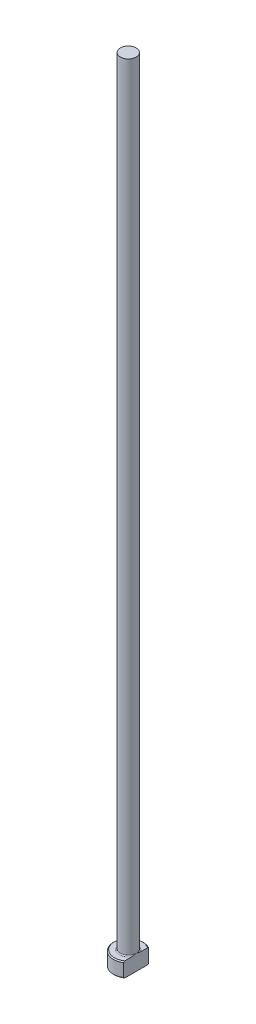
ISO-10303-21;
HEADER;
FILE_DESCRIPTION(('STEP AP214'),'2;1');
FILE_NAME('part.step','',(''),(''),'','','');
FILE_SCHEMA(('AUTOMOTIVE_DESIGN { 1 0 10303 214 1 1 1 1 }'));
ENDSEC;
DATA;
#1=APPLICATION_CONTEXT('core data for automotive mechanical design processes');
#2=APPLICATION_PROTOCOL_DEFINITION('international standard','automotive_design',2000,#1);
#3=PRODUCT_CONTEXT('',#1,'mechanical');
#4=PRODUCT('Part','Part','',(#3));
#5=PRODUCT_RELATED_PRODUCT_CATEGORY('part','',(#4));
#6=PRODUCT_DEFINITION_FORMATION('','',#4);
#7=PRODUCT_DEFINITION_CONTEXT('part definition',#1,'design');
#8=PRODUCT_DEFINITION('design','',#6,#7);
#9=PRODUCT_DEFINITION_SHAPE('','',#8);
#10=(LENGTH_UNIT() NAMED_UNIT(*) SI_UNIT(.MILLI.,.METRE.));
#11=(NAMED_UNIT(*) PLANE_ANGLE_UNIT() SI_UNIT($,.RADIAN.));
#12=(NAMED_UNIT(*) SI_UNIT($,.STERADIAN.) SOLID_ANGLE_UNIT());
#13=UNCERTAINTY_MEASURE_WITH_UNIT(LENGTH_MEASURE(1.E-05),#10,'distance_accuracy_value','');
#14=(GEOMETRIC_REPRESENTATION_CONTEXT(3) GLOBAL_UNCERTAINTY_ASSIGNED_CONTEXT((#13)) GLOBAL_UNIT_ASSIGNED_CONTEXT((#10,
#11,#12)) REPRESENTATION_CONTEXT('',''));
#15=CARTESIAN_POINT('',(0.,0.,0.));
#16=DIRECTION('',(0.,0.,1.));
#17=DIRECTION('',(1.,0.,0.));
#18=AXIS2_PLACEMENT_3D('',#15,#16,#17);
#19=CARTESIAN_POINT('',(0.,0.,0.));
#20=DIRECTION('',(0.,-1.,0.));
#21=DIRECTION('',(0.,0.,-1.));
#22=AXIS2_PLACEMENT_3D('',#19,#20,#21);
#23=PLANE('',#22);
#24=CARTESIAN_POINT('',(0.,0.,0.));
#25=DIRECTION('',(0.,-1.,0.));
#26=DIRECTION('',(0.,0.,-1.));
#27=AXIS2_PLACEMENT_3D('',#24,#25,#26);
#28=CIRCLE('',#27,2.79999999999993);
#29=CARTESIAN_POINT('',(1.59999999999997,0.,2.29782505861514));
#30=VERTEX_POINT('',#29);
#31=CARTESIAN_POINT('',(1.59999999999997,0.,-2.29782505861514));
#32=VERTEX_POINT('',#31);
#33=EDGE_CURVE('E98',#30,#32,#28,.T.);
#34=ORIENTED_EDGE('',*,*,#33,.T.);
#35=DIRECTION('',(0.,0.,1.));
#36=VECTOR('',#35,1.);
#37=CARTESIAN_POINT('',(1.59999999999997,0.,-2.53771550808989));
#38=LINE('',#37,#36);
#39=EDGE_CURVE('E83',#32,#30,#38,.T.);
#40=ORIENTED_EDGE('',*,*,#39,.T.);
#41=EDGE_LOOP('',(#34,#40));
#42=FACE_BOUND('',#41,.T.);
#43=ADVANCED_FACE('F32',(#42),#23,.T.);
#44=CARTESIAN_POINT('',(0.,259.958771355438,0.));
#45=DIRECTION('',(0.,1.,0.));
#46=DIRECTION('',(0.,0.,1.));
#47=AXIS2_PLACEMENT_3D('',#44,#45,#46);
#48=CYLINDRICAL_SURFACE('',#47,2.99999999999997);
#49=CARTESIAN_POINT('',(0.,2.80000000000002,0.));
#50=DIRECTION('',(0.,1.,0.));
#51=DIRECTION('',(0.,0.,1.));
#52=AXIS2_PLACEMENT_3D('',#49,#50,#51);
#53=CIRCLE('',#52,2.99999999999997);
#54=CARTESIAN_POINT('',(1.59999999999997,2.80000000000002,2.53771550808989));
#55=VERTEX_POINT('',#54);
#56=CARTESIAN_POINT('',(1.59999999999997,2.80000000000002,-2.53771550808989));
#57=VERTEX_POINT('',#56);
#58=EDGE_CURVE('E104',#55,#57,#53,.F.);
#59=ORIENTED_EDGE('',*,*,#58,.T.);
#60=DIRECTION('',(0.,-1.,0.));
#61=VECTOR('',#60,1.);
#62=CARTESIAN_POINT('',(1.59999999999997,160.,-2.53771550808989));
#63=LINE('',#62,#61);
#64=CARTESIAN_POINT('',(1.59999999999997,0.200000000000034,-2.53771550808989));
#65=VERTEX_POINT('',#64);
#66=EDGE_CURVE('E183',#57,#65,#63,.T.);
#67=ORIENTED_EDGE('',*,*,#66,.T.);
#68=CARTESIAN_POINT('',(0.,0.200000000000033,0.));
#69=DIRECTION('',(0.,-1.,0.));
#70=DIRECTION('',(0.,0.,-1.));
#71=AXIS2_PLACEMENT_3D('',#68,#69,#70);
#72=CIRCLE('',#71,2.99999999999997);
#73=CARTESIAN_POINT('',(1.59999999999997,0.200000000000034,2.53771550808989));
#74=VERTEX_POINT('',#73);
#75=EDGE_CURVE('E100',#65,#74,#72,.F.);
#76=ORIENTED_EDGE('',*,*,#75,.T.);
#77=DIRECTION('',(0.,-1.,0.));
#78=VECTOR('',#77,1.);
#79=CARTESIAN_POINT('',(1.59999999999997,160.,2.53771550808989));
#80=LINE('',#79,#78);
#81=EDGE_CURVE('E93',#55,#74,#80,.T.);
#82=ORIENTED_EDGE('',*,*,#81,.F.);
#83=EDGE_LOOP('',(#59,#67,#76,#82));
#84=FACE_BOUND('',#83,.T.);
#85=ADVANCED_FACE('F158',(#84),#48,.T.);
#86=CARTESIAN_POINT('',(-2.99999999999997,3.,0.));
#87=DIRECTION('',(0.,1.,0.));
#88=DIRECTION('',(0.,0.,1.));
#89=AXIS2_PLACEMENT_3D('',#86,#87,#88);
#90=PLANE('',#89);
#91=CARTESIAN_POINT('',(0.,3.,0.));
#92=DIRECTION('',(0.,1.,0.));
#93=DIRECTION('',(0.,0.,1.));
#94=AXIS2_PLACEMENT_3D('',#91,#92,#93);
#95=CIRCLE('',#94,2.79999999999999);
#96=CARTESIAN_POINT('',(1.59999999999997,3.,-2.29782505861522));
#97=VERTEX_POINT('',#96);
#98=CARTESIAN_POINT('',(1.59999999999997,3.,2.29782505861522));
#99=VERTEX_POINT('',#98);
#100=EDGE_CURVE('E178',#97,#99,#95,.T.);
#101=ORIENTED_EDGE('',*,*,#100,.T.);
#102=DIRECTION('',(0.,0.,-1.));
#103=VECTOR('',#102,1.);
#104=CARTESIAN_POINT('',(1.59999999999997,3.,0.));
#105=LINE('',#104,#103);
#106=CARTESIAN_POINT('',(1.59999999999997,2.99999999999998,0.824621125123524));
#107=VERTEX_POINT('',#106);
#108=EDGE_CURVE('E57',#99,#107,#105,.T.);
#109=ORIENTED_EDGE('',*,*,#108,.T.);
#110=CARTESIAN_POINT('',(0.,3.,0.));
#111=DIRECTION('',(0.,1.,0.));
#112=DIRECTION('',(0.,0.,1.));
#113=AXIS2_PLACEMENT_3D('',#110,#111,#112);
#114=CIRCLE('',#113,1.79999999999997);
#115=CARTESIAN_POINT('',(1.59999999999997,2.99999999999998,-0.824621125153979));
#116=VERTEX_POINT('',#115);
#117=EDGE_CURVE('E107',#107,#116,#114,.F.);
#118=ORIENTED_EDGE('',*,*,#117,.T.);
#119=EDGE_CURVE('E136',#116,#97,#105,.T.);
#120=ORIENTED_EDGE('',*,*,#119,.T.);
#121=EDGE_LOOP('',(#101,#109,#118,#120));
#122=FACE_BOUND('',#121,.T.);
#123=ADVANCED_FACE('F147',(#122),#90,.T.);
#124=CARTESIAN_POINT('',(0.,3.,0.));
#125=DIRECTION('',(0.,-1.,0.));
#126=DIRECTION('',(0.,0.,-1.));
#127=AXIS2_PLACEMENT_3D('',#124,#125,#126);
#128=CONICAL_SURFACE('',#127,2.79999999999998,0.785398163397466);
#129=ORIENTED_EDGE('',*,*,#58,.F.);
#130=CARTESIAN_POINT('',(1.59999999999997,-0.0101832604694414,5.58553753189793));
#131=CARTESIAN_POINT('',(1.59999999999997,0.0972362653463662,5.47379440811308));
#132=CARTESIAN_POINT('',(1.59999999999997,0.204532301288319,5.36193239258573));
#133=CARTESIAN_POINT('',(1.59999999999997,0.418819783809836,5.13791519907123));
#134=CARTESIAN_POINT('',(1.59999999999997,0.525811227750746,5.02576001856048));
#135=CARTESIAN_POINT('',(1.59999999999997,0.846303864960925,4.68870684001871));
#136=CARTESIAN_POINT('',(1.59999999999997,1.05925853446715,4.46328850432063));
#137=CARTESIAN_POINT('',(1.59999999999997,1.48118306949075,4.01229981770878));
#138=CARTESIAN_POINT('',(1.59999999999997,1.69017139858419,3.78674682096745));
#139=CARTESIAN_POINT('',(1.59999999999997,2.00096196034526,3.44598591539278));
#140=CARTESIAN_POINT('',(1.59999999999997,2.1041038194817,3.33200088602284));
#141=CARTESIAN_POINT('',(1.59999999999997,2.30919104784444,3.10296070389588));
#142=CARTESIAN_POINT('',(1.59999999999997,2.4111364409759,2.98790557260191));
#143=CARTESIAN_POINT('',(1.59999999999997,2.58757545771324,2.78593338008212));
#144=CARTESIAN_POINT('',(1.59999999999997,2.66243160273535,2.69933337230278));
#145=CARTESIAN_POINT('',(1.59999999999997,2.81098408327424,2.52513170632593));
#146=CARTESIAN_POINT('',(1.59999999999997,2.88468033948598,2.43752998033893));
#147=CARTESIAN_POINT('',(1.59999999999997,3.03092909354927,2.26058626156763));
#148=CARTESIAN_POINT('',(1.59999999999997,3.10347340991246,2.17123748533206));
#149=CARTESIAN_POINT('',(1.59999999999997,3.2464536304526,1.99088530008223));
#150=CARTESIAN_POINT('',(1.59999999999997,3.31688989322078,1.89988217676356));
#151=CARTESIAN_POINT('',(1.59999999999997,3.4554392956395,1.71486621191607));
#152=CARTESIAN_POINT('',(1.59999999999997,3.52352676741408,1.62083402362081));
#153=CARTESIAN_POINT('',(1.59999999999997,3.6554393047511,1.42966446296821));
#154=CARTESIAN_POINT('',(1.59999999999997,3.71926060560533,1.33252445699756));
#155=CARTESIAN_POINT('',(1.59999999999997,3.84005824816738,1.13468126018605));
#156=CARTESIAN_POINT('',(1.59999999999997,3.89706669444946,1.03399793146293));
#157=CARTESIAN_POINT('',(1.59999999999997,4.0008785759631,0.827509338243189));
#158=CARTESIAN_POINT('',(1.59999999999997,4.04770238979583,0.721714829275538));
#159=CARTESIAN_POINT('',(1.59999999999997,4.10597629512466,0.55880924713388));
#160=CARTESIAN_POINT('',(1.59999999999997,4.12339902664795,0.503846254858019));
#161=CARTESIAN_POINT('',(1.59999999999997,4.15340775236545,0.392598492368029));
#162=CARTESIAN_POINT('',(1.59999999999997,4.16599453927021,0.336313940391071));
#163=CARTESIAN_POINT('',(1.59999999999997,4.18546795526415,0.223146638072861));
#164=CARTESIAN_POINT('',(1.59999999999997,4.19239315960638,0.166270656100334));
#165=CARTESIAN_POINT('',(1.59999999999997,4.20016451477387,0.0521012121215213));
#166=CARTESIAN_POINT('',(1.59999999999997,4.2010113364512,-0.00519220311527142));
#167=CARTESIAN_POINT('',(1.59999999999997,4.19655603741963,-0.119606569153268));
#168=CARTESIAN_POINT('',(1.59999999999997,4.19124611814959,-0.176727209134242));
#169=CARTESIAN_POINT('',(1.59999999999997,4.17487728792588,-0.290132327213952));
#170=CARTESIAN_POINT('',(1.59999999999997,4.1638171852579,-0.346416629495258));
#171=CARTESIAN_POINT('',(1.59999999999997,4.13658168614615,-0.458175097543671));
#172=CARTESIAN_POINT('',(1.59999999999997,4.12036718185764,-0.513639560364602));
#173=CARTESIAN_POINT('',(1.59999999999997,4.08371568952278,-0.623133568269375));
#174=CARTESIAN_POINT('',(1.59999999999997,4.06327861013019,-0.677163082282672));
#175=CARTESIAN_POINT('',(1.59999999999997,4.01384079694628,-0.796206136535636));
#176=CARTESIAN_POINT('',(1.59999999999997,3.98395404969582,-0.860848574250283));
#177=CARTESIAN_POINT('',(1.59999999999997,3.92024875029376,-0.988182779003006));
#178=CARTESIAN_POINT('',(1.59999999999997,3.88642788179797,-1.05087336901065));
#179=CARTESIAN_POINT('',(1.59999999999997,3.81575061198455,-1.17466308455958));
#180=CARTESIAN_POINT('',(1.59999999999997,3.77888858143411,-1.23575897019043));
#181=CARTESIAN_POINT('',(1.59999999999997,3.70287361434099,-1.35651466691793));
#182=CARTESIAN_POINT('',(1.59999999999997,3.66372022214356,-1.41617418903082));
#183=CARTESIAN_POINT('',(1.59999999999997,3.54280392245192,-1.59458184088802));
#184=CARTESIAN_POINT('',(1.59999999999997,3.45833719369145,-1.7114924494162));
#185=CARTESIAN_POINT('',(1.59999999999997,3.28508486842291,-1.94177313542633));
#186=CARTESIAN_POINT('',(1.59999999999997,3.19630496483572,-2.05514757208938));
#187=CARTESIAN_POINT('',(1.59999999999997,2.98139222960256,-2.32229937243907));
#188=CARTESIAN_POINT('',(1.59999999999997,2.85392433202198,-2.47499901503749));
#189=CARTESIAN_POINT('',(1.59999999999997,2.59557502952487,-2.7774916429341));
#190=CARTESIAN_POINT('',(1.59999999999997,2.46469312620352,-2.92728419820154));
#191=CARTESIAN_POINT('',(1.59999999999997,2.20054459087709,-3.22502658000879));
#192=CARTESIAN_POINT('',(1.59999999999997,2.06727561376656,-3.37297432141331));
#193=CARTESIAN_POINT('',(1.59999999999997,1.79919464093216,-3.66744344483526));
#194=CARTESIAN_POINT('',(1.59999999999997,1.66438274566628,-3.81396491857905));
#195=CARTESIAN_POINT('',(1.59999999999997,1.40205824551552,-4.09689102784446));
#196=CARTESIAN_POINT('',(1.59999999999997,1.27461301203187,-4.23335821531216));
#197=CARTESIAN_POINT('',(1.59999999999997,1.01897493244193,-4.50559511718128));
#198=CARTESIAN_POINT('',(1.59999999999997,0.890782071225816,-4.64136481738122));
#199=CARTESIAN_POINT('',(1.59999999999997,0.634049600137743,-4.91211710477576));
#200=CARTESIAN_POINT('',(1.59999999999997,0.50551101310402,-5.04710066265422));
#201=CARTESIAN_POINT('',(1.59999999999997,0.247978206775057,-5.31662434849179));
#202=CARTESIAN_POINT('',(1.59999999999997,0.118984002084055,-5.45116449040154));
#203=CARTESIAN_POINT('',(1.59999999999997,-0.0101832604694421,-5.58553753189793));
#204=B_SPLINE_CURVE_WITH_KNOTS('',3,(#130,#131,#132,#133,#134,#135,#136,#137,#138,#139,#140,
#141,#142,#143,#144,#145,#146,#147,#148,#149,#150,#151,#152,#153,#154,#155,#156,#157,#158,#159,
#160,#161,#162,#163,#164,#165,#166,#167,#168,#169,#170,#171,#172,#173,#174,#175,#176,#177,#178,
#179,#180,#181,#182,#183,#184,#185,#186,#187,#188,#189,#190,#191,#192,#193,#194,#195,#196,#197,
#198,#199,#200,#201,#202,#203),.UNSPECIFIED.,.F.,.F.,(4,2,2,2,2,2,2,2,2,2,2,2,2,2,2,2,2,2,2,2,2,
2,2,2,2,2,2,2,2,2,2,2,2,2,2,2,4),(0.,0.465004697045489,0.930013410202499,1.86031116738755,
2.7827539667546,3.24391793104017,3.70507266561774,4.04847005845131,4.39189082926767,
4.73714054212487,5.08233118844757,5.43053718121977,5.77904650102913,6.12584271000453,
6.47193849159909,6.644737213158,6.81750759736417,6.98909076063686,7.16065498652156,
7.33243676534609,7.50425415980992,7.67740760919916,7.85056480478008,8.06403310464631,
8.27762773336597,8.49162700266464,8.70566897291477,9.1381640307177,9.57010297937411,
10.166739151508,10.763462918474,11.3608091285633,11.9581166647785,12.5182829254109,
13.0784605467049,13.6376414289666,14.1968045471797),.UNSPECIFIED.);
#205=EDGE_CURVE('E135',#55,#99,#204,.T.);
#206=ORIENTED_EDGE('',*,*,#205,.T.);
#207=ORIENTED_EDGE('',*,*,#100,.F.);
#208=EDGE_CURVE('E127',#97,#57,#204,.T.);
#209=ORIENTED_EDGE('',*,*,#208,.T.);
#210=EDGE_LOOP('',(#129,#206,#207,#209));
#211=FACE_BOUND('',#210,.T.);
#212=ADVANCED_FACE('F143',(#211),#128,.T.);
#213=CARTESIAN_POINT('',(0.,0.200000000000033,0.));
#214=DIRECTION('',(0.,1.,0.));
#215=DIRECTION('',(0.,0.,1.));
#216=AXIS2_PLACEMENT_3D('',#213,#214,#215);
#217=CONICAL_SURFACE('',#216,2.99999999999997,0.785398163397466);
#218=ORIENTED_EDGE('',*,*,#75,.F.);
#219=CARTESIAN_POINT('',(1.59999999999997,3.0101832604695,-5.58553753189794));
#220=CARTESIAN_POINT('',(1.59999999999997,2.90276373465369,-5.47379440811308));
#221=CARTESIAN_POINT('',(1.59999999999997,2.79546769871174,-5.36193239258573));
#222=CARTESIAN_POINT('',(1.59999999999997,2.58118021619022,-5.13791519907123));
#223=CARTESIAN_POINT('',(1.59999999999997,2.47418877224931,-5.02576001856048));
#224=CARTESIAN_POINT('',(1.59999999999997,2.15369613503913,-4.68870684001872));
#225=CARTESIAN_POINT('',(1.59999999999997,1.94074146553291,-4.46328850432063));
#226=CARTESIAN_POINT('',(1.59999999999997,1.5188169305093,-4.01229981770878));
#227=CARTESIAN_POINT('',(1.59999999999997,1.30982860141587,-3.78674682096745));
#228=CARTESIAN_POINT('',(1.59999999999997,0.9990380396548,-3.44598591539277));
#229=CARTESIAN_POINT('',(1.59999999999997,0.895896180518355,-3.33200088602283));
#230=CARTESIAN_POINT('',(1.59999999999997,0.690808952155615,-3.10296070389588));
#231=CARTESIAN_POINT('',(1.59999999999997,0.588863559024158,-2.98790557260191));
#232=CARTESIAN_POINT('',(1.59999999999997,0.412424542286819,-2.78593338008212));
#233=CARTESIAN_POINT('',(1.59999999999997,0.337568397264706,-2.69933337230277));
#234=CARTESIAN_POINT('',(1.59999999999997,0.189015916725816,-2.52513170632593));
#235=CARTESIAN_POINT('',(1.59999999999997,0.115319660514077,-2.43752998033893));
#236=CARTESIAN_POINT('',(1.59999999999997,-0.0309290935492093,-2.26058626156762));
#237=CARTESIAN_POINT('',(1.59999999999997,-0.103473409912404,-2.17123748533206));
#238=CARTESIAN_POINT('',(1.59999999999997,-0.246453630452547,-1.99088530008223));
#239=CARTESIAN_POINT('',(1.59999999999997,-0.316889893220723,-1.89988217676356));
#240=CARTESIAN_POINT('',(1.59999999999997,-0.455439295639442,-1.71486621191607));
#241=CARTESIAN_POINT('',(1.59999999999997,-0.523526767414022,-1.62083402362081));
#242=CARTESIAN_POINT('',(1.59999999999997,-0.655439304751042,-1.42966446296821));
#243=CARTESIAN_POINT('',(1.59999999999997,-0.719260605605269,-1.33252445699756));
#244=CARTESIAN_POINT('',(1.59999999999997,-0.840058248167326,-1.13468126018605));
#245=CARTESIAN_POINT('',(1.59999999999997,-0.897066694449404,-1.03399793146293));
#246=CARTESIAN_POINT('',(1.59999999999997,-1.00087857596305,-0.82750933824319));
#247=CARTESIAN_POINT('',(1.59999999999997,-1.04770238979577,-0.72171482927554));
#248=CARTESIAN_POINT('',(1.59999999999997,-1.1059762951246,-0.558809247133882));
#249=CARTESIAN_POINT('',(1.59999999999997,-1.12339902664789,-0.50384625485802));
#250=CARTESIAN_POINT('',(1.59999999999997,-1.15340775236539,-0.39259849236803));
#251=CARTESIAN_POINT('',(1.59999999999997,-1.16599453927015,-0.336313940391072));
#252=CARTESIAN_POINT('',(1.59999999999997,-1.18546795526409,-0.223146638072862));
#253=CARTESIAN_POINT('',(1.59999999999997,-1.19239315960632,-0.166270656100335));
#254=CARTESIAN_POINT('',(1.59999999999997,-1.20016451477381,-0.0521012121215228));
#255=CARTESIAN_POINT('',(1.59999999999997,-1.20101133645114,0.00519220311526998));
#256=CARTESIAN_POINT('',(1.59999999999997,-1.19655603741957,0.119606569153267));
#257=CARTESIAN_POINT('',(1.59999999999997,-1.19124611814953,0.176727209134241));
#258=CARTESIAN_POINT('',(1.59999999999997,-1.17487728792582,0.290132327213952));
#259=CARTESIAN_POINT('',(1.59999999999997,-1.16381718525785,0.346416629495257));
#260=CARTESIAN_POINT('',(1.59999999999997,-1.1365816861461,0.45817509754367));
#261=CARTESIAN_POINT('',(1.59999999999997,-1.12036718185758,0.5136395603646));
#262=CARTESIAN_POINT('',(1.59999999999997,-1.08371568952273,0.623133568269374));
#263=CARTESIAN_POINT('',(1.59999999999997,-1.06327861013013,0.677163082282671));
#264=CARTESIAN_POINT('',(1.59999999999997,-1.01384079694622,0.796206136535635));
#265=CARTESIAN_POINT('',(1.59999999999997,-0.983954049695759,0.860848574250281));
#266=CARTESIAN_POINT('',(1.59999999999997,-0.920248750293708,0.988182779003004));
#267=CARTESIAN_POINT('',(1.59999999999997,-0.886427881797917,1.05087336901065));
#268=CARTESIAN_POINT('',(1.59999999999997,-0.815750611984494,1.17466308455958));
#269=CARTESIAN_POINT('',(1.59999999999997,-0.778888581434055,1.23575897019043));
#270=CARTESIAN_POINT('',(1.59999999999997,-0.702873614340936,1.35651466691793));
#271=CARTESIAN_POINT('',(1.59999999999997,-0.663720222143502,1.41617418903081));
#272=CARTESIAN_POINT('',(1.59999999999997,-0.542803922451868,1.59458184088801));
#273=CARTESIAN_POINT('',(1.59999999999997,-0.458337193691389,1.7114924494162));
#274=CARTESIAN_POINT('',(1.59999999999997,-0.28508486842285,1.94177313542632));
#275=CARTESIAN_POINT('',(1.59999999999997,-0.196304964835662,2.05514757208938));
#276=CARTESIAN_POINT('',(1.59999999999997,0.0186077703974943,2.32229937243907));
#277=CARTESIAN_POINT('',(1.59999999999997,0.146075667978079,2.47499901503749));
#278=CARTESIAN_POINT('',(1.59999999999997,0.404424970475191,2.7774916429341));
#279=CARTESIAN_POINT('',(1.59999999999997,0.535306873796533,2.92728419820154));
#280=CARTESIAN_POINT('',(1.59999999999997,0.799455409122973,3.22502658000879));
#281=CARTESIAN_POINT('',(1.59999999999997,0.932724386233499,3.37297432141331));
#282=CARTESIAN_POINT('',(1.59999999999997,1.20080535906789,3.66744344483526));
#283=CARTESIAN_POINT('',(1.59999999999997,1.33561725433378,3.81396491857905));
#284=CARTESIAN_POINT('',(1.59999999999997,1.59794175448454,4.09689102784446));
#285=CARTESIAN_POINT('',(1.59999999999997,1.72538698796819,4.23335821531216));
#286=CARTESIAN_POINT('',(1.59999999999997,1.98102506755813,4.50559511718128));
#287=CARTESIAN_POINT('',(1.59999999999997,2.10921792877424,4.64136481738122));
#288=CARTESIAN_POINT('',(1.59999999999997,2.36595039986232,4.91211710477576));
#289=CARTESIAN_POINT('',(1.59999999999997,2.49448898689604,5.04710066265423));
#290=CARTESIAN_POINT('',(1.59999999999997,2.752021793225,5.31662434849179));
#291=CARTESIAN_POINT('',(1.59999999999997,2.881015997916,5.45116449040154));
#292=CARTESIAN_POINT('',(1.59999999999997,3.0101832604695,5.58553753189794));
#293=B_SPLINE_CURVE_WITH_KNOTS('',3,(#219,#220,#221,#222,#223,#224,#225,#226,#227,#228,#229,
#230,#231,#232,#233,#234,#235,#236,#237,#238,#239,#240,#241,#242,#243,#244,#245,#246,#247,#248,
#249,#250,#251,#252,#253,#254,#255,#256,#257,#258,#259,#260,#261,#262,#263,#264,#265,#266,#267,
#268,#269,#270,#271,#272,#273,#274,#275,#276,#277,#278,#279,#280,#281,#282,#283,#284,#285,#286,
#287,#288,#289,#290,#291,#292),.UNSPECIFIED.,.F.,.F.,(4,2,2,2,2,2,2,2,2,2,2,2,2,2,2,2,2,2,2,2,2,
2,2,2,2,2,2,2,2,2,2,2,2,2,2,2,4),(0.,0.46500469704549,0.9300134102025,1.86031116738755,
2.7827539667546,3.24391793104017,3.70507266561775,4.04847005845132,4.39189082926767,
4.73714054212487,5.08233118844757,5.43053718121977,5.77904650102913,6.12584271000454,
6.47193849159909,6.644737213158,6.81750759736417,6.98909076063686,7.16065498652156,
7.3324367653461,7.50425415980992,7.67740760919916,7.85056480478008,8.06403310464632,
8.27762773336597,8.49162700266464,8.70566897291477,9.1381640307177,9.57010297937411,
10.166739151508,10.763462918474,11.3608091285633,11.9581166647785,12.5182829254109,
13.0784605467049,13.6376414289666,14.1968045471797),.UNSPECIFIED.);
#294=EDGE_CURVE('E86',#65,#32,#293,.T.);
#295=ORIENTED_EDGE('',*,*,#294,.T.);
#296=ORIENTED_EDGE('',*,*,#33,.F.);
#297=EDGE_CURVE('E89',#30,#74,#293,.T.);
#298=ORIENTED_EDGE('',*,*,#297,.T.);
#299=EDGE_LOOP('',(#218,#295,#296,#298));
#300=FACE_BOUND('',#299,.T.);
#301=ADVANCED_FACE('F97',(#300),#217,.T.);
#302=CARTESIAN_POINT('',(0.,3.19999999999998,0.));
#303=DIRECTION('',(0.,1.,0.));
#304=DIRECTION('',(0.,0.,1.));
#305=AXIS2_PLACEMENT_3D('',#302,#303,#304);
#306=TOROIDAL_SURFACE('',#305,1.79999999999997,0.2);
#307=CARTESIAN_POINT('',(1.59999999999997,3.19999999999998,0.));
#308=CARTESIAN_POINT('',(1.59999999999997,3.20000050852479,4.54943754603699E-11));
#309=CARTESIAN_POINT('',(1.59999999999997,3.20000101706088,-1.26961255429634E-07));
#310=CARTESIAN_POINT('',(1.59999999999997,3.20000198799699,-5.15663776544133E-07));
#311=CARTESIAN_POINT('',(1.59999999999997,3.20000244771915,-7.82570768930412E-07));
#312=CARTESIAN_POINT('',(1.59999999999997,3.20000337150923,-1.42107859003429E-06));
#313=CARTESIAN_POINT('',(1.59999999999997,3.2000038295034,-1.8013897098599E-06));
#314=CARTESIAN_POINT('',(1.59999999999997,3.20000468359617,-2.61302269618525E-06));
#315=CARTESIAN_POINT('',(1.59999999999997,3.20000508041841,-3.04362154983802E-06));
#316=CARTESIAN_POINT('',(1.59999999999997,3.20000644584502,-4.61783099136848E-06));
#317=CARTESIAN_POINT('',(1.59999999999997,3.2000073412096,-5.82629496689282E-06));
#318=CARTESIAN_POINT('',(1.59999999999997,3.20000890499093,-8.29532278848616E-06));
#319=CARTESIAN_POINT('',(1.59999999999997,3.2000095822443,-9.55059430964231E-06));
#320=CARTESIAN_POINT('',(1.59999999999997,3.2000122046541,-1.4561779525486E-05));
#321=CARTESIAN_POINT('',(1.59999999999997,3.20001402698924,-1.8385925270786E-05));
#322=CARTESIAN_POINT('',(1.59999999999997,3.20001693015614,-2.58398167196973E-05));
#323=CARTESIAN_POINT('',(1.59999999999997,3.20001806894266,-2.9447492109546E-05));
#324=CARTESIAN_POINT('',(1.59999999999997,3.20002303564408,-4.5117550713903E-05));
#325=CARTESIAN_POINT('',(1.59999999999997,3.20002690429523,-5.71577768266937E-05));
#326=CARTESIAN_POINT('',(1.59999999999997,3.20003298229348,-7.95113108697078E-05));
#327=CARTESIAN_POINT('',(1.59999999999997,3.20003536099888,-8.97762976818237E-05));
#328=CARTESIAN_POINT('',(1.59999999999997,3.20005453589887,-0.000165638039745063));
#329=CARTESIAN_POINT('',(1.59999999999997,3.20007944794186,-0.000228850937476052));
#330=CARTESIAN_POINT('',(1.59999999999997,3.20017354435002,-0.000476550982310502));
#331=CARTESIAN_POINT('',(1.59999999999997,3.20023667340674,-0.000662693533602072));
#332=CARTESIAN_POINT('',(1.59999999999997,3.2004875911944,-0.00139193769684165));
#333=CARTESIAN_POINT('',(1.59999999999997,3.20068172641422,-0.00193335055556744));
#334=CARTESIAN_POINT('',(1.59999999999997,3.20147743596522,-0.00416279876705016));
#335=CARTESIAN_POINT('',(1.59999999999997,3.20207183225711,-0.00585269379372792));
#336=CARTESIAN_POINT('',(1.59999999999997,3.2087643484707,-0.0248666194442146));
#337=CARTESIAN_POINT('',(1.59999999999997,3.21490191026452,-0.0421807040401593));
#338=CARTESIAN_POINT('',(1.59999999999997,3.22687857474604,-0.0761752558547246));
#339=CARTESIAN_POINT('',(1.59999999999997,3.23272018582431,-0.092854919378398));
#340=CARTESIAN_POINT('',(1.59999999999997,3.2450295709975,-0.128242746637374));
#341=CARTESIAN_POINT('',(1.59999999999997,3.25148835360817,-0.146954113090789));
#342=CARTESIAN_POINT('',(1.59999999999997,3.26432449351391,-0.18462192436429));
#343=CARTESIAN_POINT('',(1.59999999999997,3.27070030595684,-0.203578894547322));
#344=CARTESIAN_POINT('',(1.59999999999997,3.2861130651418,-0.250227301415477));
#345=CARTESIAN_POINT('',(1.59999999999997,3.29503653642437,-0.277956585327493));
#346=CARTESIAN_POINT('',(1.59999999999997,3.31206503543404,-0.332930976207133));
#347=CARTESIAN_POINT('',(1.59999999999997,3.32018465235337,-0.360171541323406));
#348=CARTESIAN_POINT('',(1.59999999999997,3.33730366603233,-0.420681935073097));
#349=CARTESIAN_POINT('',(1.59999999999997,3.34612355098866,-0.454003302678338));
#350=CARTESIAN_POINT('',(1.59999999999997,3.36232017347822,-0.521270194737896));
#351=CARTESIAN_POINT('',(1.59999999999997,3.36968538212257,-0.555218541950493));
#352=CARTESIAN_POINT('',(1.59999999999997,3.38286655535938,-0.625950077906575));
#353=CARTESIAN_POINT('',(1.59999999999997,3.3885334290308,-0.6627618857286));
#354=CARTESIAN_POINT('',(1.59999999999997,3.3967820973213,-0.736647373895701));
#355=CARTESIAN_POINT('',(1.59999999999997,3.39937308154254,-0.773719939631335));
#356=CARTESIAN_POINT('',(1.59999999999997,3.40041949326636,-0.847207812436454));
#357=CARTESIAN_POINT('',(1.59999999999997,3.39895641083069,-0.88362147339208));
#358=CARTESIAN_POINT('',(1.59999999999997,3.39061157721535,-0.955314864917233));
#359=CARTESIAN_POINT('',(1.59999999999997,3.3838299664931,-0.990603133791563));
#360=CARTESIAN_POINT('',(1.59999999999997,3.36933665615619,-1.03710764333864));
#361=CARTESIAN_POINT('',(1.59999999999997,3.36495855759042,-1.04936206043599));
#362=CARTESIAN_POINT('',(1.59999999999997,3.35498242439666,-1.07342013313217));
#363=CARTESIAN_POINT('',(1.59999999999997,3.34938064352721,-1.08522227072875));
#364=CARTESIAN_POINT('',(1.59999999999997,3.33671785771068,-1.10815425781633));
#365=CARTESIAN_POINT('',(1.59999999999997,3.32964542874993,-1.11927790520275));
#366=CARTESIAN_POINT('',(1.59999999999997,3.31385032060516,-1.14028316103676));
#367=CARTESIAN_POINT('',(1.59999999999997,3.30513251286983,-1.15016829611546));
#368=CARTESIAN_POINT('',(1.59999999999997,3.2893714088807,-1.16476986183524));
#369=CARTESIAN_POINT('',(1.59999999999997,3.28286385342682,-1.17006219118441));
#370=CARTESIAN_POINT('',(1.59999999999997,3.26911414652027,-1.179603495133));
#371=CARTESIAN_POINT('',(1.59999999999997,3.2618722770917,-1.18385286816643));
#372=CARTESIAN_POINT('',(1.59999999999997,3.24665711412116,-1.19105502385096));
#373=CARTESIAN_POINT('',(1.59999999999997,3.23867649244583,-1.19399264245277));
#374=CARTESIAN_POINT('',(1.59999999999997,3.22228884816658,-1.19821047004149));
#375=CARTESIAN_POINT('',(1.59999999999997,3.21388246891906,-1.19949310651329));
#376=CARTESIAN_POINT('',(1.59999999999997,3.19822871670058,-1.20020429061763));
#377=CARTESIAN_POINT('',(1.59999999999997,3.19099166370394,-1.19987658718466));
#378=CARTESIAN_POINT('',(1.59999999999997,3.1766911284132,-1.19794337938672));
#379=CARTESIAN_POINT('',(1.59999999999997,3.16962767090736,-1.19633769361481));
#380=CARTESIAN_POINT('',(1.59999999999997,3.15619326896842,-1.19208069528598));
#381=CARTESIAN_POINT('',(1.59999999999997,3.14980538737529,-1.18948176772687));
#382=CARTESIAN_POINT('',(1.59999999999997,3.13747056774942,-1.18339991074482));
#383=CARTESIAN_POINT('',(1.59999999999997,3.13152374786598,-1.17991674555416));
#384=CARTESIAN_POINT('',(1.59999999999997,3.11701630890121,-1.17013377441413));
#385=CARTESIAN_POINT('',(1.59999999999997,3.10879365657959,-1.16333250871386));
#386=CARTESIAN_POINT('',(1.59999999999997,3.09352344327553,-1.14851362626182));
#387=CARTESIAN_POINT('',(1.59999999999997,3.08647946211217,-1.14049244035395));
#388=CARTESIAN_POINT('',(1.59999999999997,3.06978612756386,-1.11881325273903));
#389=CARTESIAN_POINT('',(1.59999999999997,3.06093454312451,-1.10454463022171));
#390=CARTESIAN_POINT('',(1.59999999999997,3.045486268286,-1.07488732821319));
#391=CARTESIAN_POINT('',(1.59999999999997,3.03889016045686,-1.05949836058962));
#392=CARTESIAN_POINT('',(1.59999999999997,3.02310414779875,-1.01585357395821));
#393=CARTESIAN_POINT('',(1.59999999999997,3.01588276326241,-0.98689334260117));
#394=CARTESIAN_POINT('',(1.59999999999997,3.00554634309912,-0.927965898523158));
#395=CARTESIAN_POINT('',(1.59999999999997,3.00248580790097,-0.89799049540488));
#396=CARTESIAN_POINT('',(1.59999999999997,2.99950013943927,-0.836442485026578));
#397=CARTESIAN_POINT('',(1.59999999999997,2.99973474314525,-0.804863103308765));
#398=CARTESIAN_POINT('',(1.59999999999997,3.00289974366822,-0.74177978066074));
#399=CARTESIAN_POINT('',(1.59999999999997,3.00583724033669,-0.710276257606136));
#400=CARTESIAN_POINT('',(1.59999999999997,3.01360294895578,-0.649223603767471));
#401=CARTESIAN_POINT('',(1.59999999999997,3.01832173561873,-0.61965999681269));
#402=CARTESIAN_POINT('',(1.59999999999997,3.02922114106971,-0.561003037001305));
#403=CARTESIAN_POINT('',(1.59999999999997,3.03539231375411,-0.531907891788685));
#404=CARTESIAN_POINT('',(1.59999999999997,3.05057454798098,-0.466833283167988));
#405=CARTESIAN_POINT('',(1.59999999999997,3.05991050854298,-0.430930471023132));
#406=CARTESIAN_POINT('',(1.59999999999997,3.08015300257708,-0.358646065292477));
#407=CARTESIAN_POINT('',(1.59999999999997,3.09109187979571,-0.322273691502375));
#408=CARTESIAN_POINT('',(1.59999999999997,3.11028869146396,-0.261379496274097));
#409=CARTESIAN_POINT('',(1.59999999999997,3.1182898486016,-0.236775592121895));
#410=CARTESIAN_POINT('',(1.59999999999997,3.13453271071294,-0.18793162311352));
#411=CARTESIAN_POINT('',(1.59999999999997,3.14277104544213,-0.163690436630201));
#412=CARTESIAN_POINT('',(1.59999999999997,3.158545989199,-0.117881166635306));
#413=CARTESIAN_POINT('',(1.59999999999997,3.16606272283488,-0.0963061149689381));
#414=CARTESIAN_POINT('',(1.59999999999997,3.18151152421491,-0.0523381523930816));
#415=CARTESIAN_POINT('',(1.59999999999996,3.18944823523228,-0.0299467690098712));
#416=CARTESIAN_POINT('',(1.59999999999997,3.19792848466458,-0.0058516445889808));
#417=CARTESIAN_POINT('',(1.59999999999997,3.19852328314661,-0.00416072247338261));
#418=CARTESIAN_POINT('',(1.59999999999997,3.19931909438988,-0.00193103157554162));
#419=CARTESIAN_POINT('',(1.59999999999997,3.19951294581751,-0.00139040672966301));
#420=CARTESIAN_POINT('',(1.59999999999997,3.19976352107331,-0.000662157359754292));
#421=CARTESIAN_POINT('',(1.59999999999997,3.19982658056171,-0.000476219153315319));
#422=CARTESIAN_POINT('',(1.59999999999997,3.19992058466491,-0.000228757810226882));
#423=CARTESIAN_POINT('',(1.59999999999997,3.19994548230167,-0.000165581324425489));
#424=CARTESIAN_POINT('',(1.59999999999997,3.19996464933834,-8.97604211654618E-05));
#425=CARTESIAN_POINT('',(1.59999999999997,3.19996702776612,-7.94979693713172E-05));
#426=CARTESIAN_POINT('',(1.59999999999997,3.19997310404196,-5.71501112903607E-05));
#427=CARTESIAN_POINT('',(1.59999999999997,3.19997697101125,-4.51129589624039E-05));
#428=CARTESIAN_POINT('',(1.59999999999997,3.19998193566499,-2.94463390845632E-05));
#429=CARTESIAN_POINT('',(1.59999999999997,3.19998307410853,-2.58390376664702E-05));
#430=CARTESIAN_POINT('',(1.59999999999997,3.1999859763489,-1.83858674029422E-05));
#431=CARTESIAN_POINT('',(1.59999999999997,3.19998779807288,-1.45620535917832E-05));
#432=CARTESIAN_POINT('',(1.59999999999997,3.19999041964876,-9.55118975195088E-06));
#433=CARTESIAN_POINT('',(1.59999999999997,3.19999109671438,-8.29594696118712E-06));
#434=CARTESIAN_POINT('',(1.59999999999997,3.19999266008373,-5.82694057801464E-06));
#435=CARTESIAN_POINT('',(1.59999999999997,3.19999355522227,-4.61846686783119E-06));
#436=CARTESIAN_POINT('',(1.59999999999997,3.19999492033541,-3.04420143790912E-06));
#437=CARTESIAN_POINT('',(1.59999999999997,3.19999531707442,-2.61357770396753E-06));
#438=CARTESIAN_POINT('',(1.59999999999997,3.19999617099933,-1.80187998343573E-06));
#439=CARTESIAN_POINT('',(1.59999999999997,3.19999662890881,-1.4215287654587E-06));
#440=CARTESIAN_POINT('',(1.59999999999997,3.19999755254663,-7.8292447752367E-07));
#441=CARTESIAN_POINT('',(1.59999999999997,3.199998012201,-5.1596356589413E-07));
#442=CARTESIAN_POINT('',(1.59999999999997,3.19999898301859,-1.27129000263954E-07));
#443=CARTESIAN_POINT('',(1.59999999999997,3.19999949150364,-4.54918281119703E-11));
#444=CARTESIAN_POINT('',(1.59999999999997,3.19999999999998,0.));
#445=B_SPLINE_CURVE_WITH_KNOTS('',3,(#307,#308,#309,#310,#311,#312,#313,#314,#315,#316,#317,
#318,#319,#320,#321,#322,#323,#324,#325,#326,#327,#328,#329,#330,#331,#332,#333,#334,#335,#336,
#337,#338,#339,#340,#341,#342,#343,#344,#345,#346,#347,#348,#349,#350,#351,#352,#353,#354,#355,
#356,#357,#358,#359,#360,#361,#362,#363,#364,#365,#366,#367,#368,#369,#370,#371,#372,#373,#374,
#375,#376,#377,#378,#379,#380,#381,#382,#383,#384,#385,#386,#387,#388,#389,#390,#391,#392,#393,
#394,#395,#396,#397,#398,#399,#400,#401,#402,#403,#404,#405,#406,#407,#408,#409,#410,#411,#412,
#413,#414,#415,#416,#417,#418,#419,#420,#421,#422,#423,#424,#425,#426,#427,#428,#429,#430,#431,
#432,#433,#434,#435,#436,#437,#438,#439,#440,#441,#442,#443,#444),.UNSPECIFIED.,.T.,.F.,(4,2,2,
2,2,2,2,2,2,2,2,2,2,2,2,2,2,2,2,2,2,2,2,2,2,2,2,2,2,2,2,2,2,2,2,2,2,2,2,2,2,2,2,2,2,2,2,2,2,2,2,
2,2,2,2,2,2,2,2,2,2,2,2,2,2,2,2,2,4),(0.,1.52634300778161E-06,3.11406916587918E-06,
4.89195151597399E-06,6.64684989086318E-06,1.11381074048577E-05,1.54135914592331E-05,
2.80880177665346E-05,3.94249647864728E-05,7.7360103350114E-05,0.000108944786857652,
0.000312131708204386,0.00090234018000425,0.00262715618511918,0.00800204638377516,
0.0631063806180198,0.116126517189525,0.175509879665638,0.235510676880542,0.322894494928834,
0.408161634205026,0.511541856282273,0.615711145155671,0.727355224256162,0.838664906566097,
0.947753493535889,1.05483601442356,1.09382604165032,1.13293715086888,1.17236425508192,
1.21167640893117,1.23676182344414,1.26183763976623,1.28719627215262,1.31251766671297,
1.33413541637,1.35575623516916,1.37636641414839,1.39698209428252,1.42881268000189,
1.46073825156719,1.51082746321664,1.56092960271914,1.64997182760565,1.74016947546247,
1.83475408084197,1.92958784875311,2.01935385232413,2.10855142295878,2.21980473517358,
2.33373085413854,2.4113451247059,2.48815160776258,2.55669374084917,2.62795640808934,
2.63333459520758,2.63505690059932,2.63564646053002,2.63584953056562,2.63588110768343,
2.6359190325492,2.63593036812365,2.63594304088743,2.63594731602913,2.63595180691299,
2.63595356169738,2.63595533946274,2.63595692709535,2.63595845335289),.UNSPECIFIED.);
#446=CARTESIAN_POINT('',(1.59999999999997,3.19999999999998,0.));
#447=VERTEX_POINT('',#446);
#448=EDGE_CURVE('E11',#116,#447,#445,.T.);
#449=ORIENTED_EDGE('',*,*,#448,.F.);
#450=ORIENTED_EDGE('',*,*,#117,.F.);
#451=CARTESIAN_POINT('',(1.59999999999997,3.19999999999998,0.));
#452=CARTESIAN_POINT('',(1.59999999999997,3.19999949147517,-4.54943940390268E-11));
#453=CARTESIAN_POINT('',(1.59999999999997,3.19999898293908,1.26961255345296E-07));
#454=CARTESIAN_POINT('',(1.59999999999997,3.19999801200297,5.1566377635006E-07));
#455=CARTESIAN_POINT('',(1.59999999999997,3.19999755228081,7.82570768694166E-07));
#456=CARTESIAN_POINT('',(1.59999999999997,3.19999662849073,1.4210785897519E-06));
#457=CARTESIAN_POINT('',(1.59999999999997,3.19999617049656,1.80138970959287E-06));
#458=CARTESIAN_POINT('',(1.59999999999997,3.19999531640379,2.61302269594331E-06));
#459=CARTESIAN_POINT('',(1.59999999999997,3.19999491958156,3.04362154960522E-06));
#460=CARTESIAN_POINT('',(1.59999999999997,3.19999355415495,4.61783099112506E-06));
#461=CARTESIAN_POINT('',(1.59999999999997,3.19999265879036,5.82629496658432E-06));
#462=CARTESIAN_POINT('',(1.59999999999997,3.19999109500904,8.29532278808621E-06));
#463=CARTESIAN_POINT('',(1.59999999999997,3.19999041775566,9.55059430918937E-06));
#464=CARTESIAN_POINT('',(1.59999999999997,3.19998779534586,1.45617795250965E-05));
#465=CARTESIAN_POINT('',(1.59999999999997,3.19998597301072,1.83859252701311E-05));
#466=CARTESIAN_POINT('',(1.59999999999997,3.19998306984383,2.58398167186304E-05));
#467=CARTESIAN_POINT('',(1.59999999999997,3.1999819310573,2.94474921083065E-05));
#468=CARTESIAN_POINT('',(1.59999999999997,3.19997696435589,4.51175507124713E-05));
#469=CARTESIAN_POINT('',(1.59999999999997,3.19997309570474,5.7157776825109E-05));
#470=CARTESIAN_POINT('',(1.59999999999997,3.19996701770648,7.95113108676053E-05));
#471=CARTESIAN_POINT('',(1.59999999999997,3.19996463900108,8.9776297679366E-05));
#472=CARTESIAN_POINT('',(1.59999999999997,3.19994546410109,0.000165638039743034));
#473=CARTESIAN_POINT('',(1.59999999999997,3.1999205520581,0.000228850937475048));
#474=CARTESIAN_POINT('',(1.59999999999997,3.19982645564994,0.000476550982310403));
#475=CARTESIAN_POINT('',(1.59999999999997,3.19976332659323,0.000662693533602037));
#476=CARTESIAN_POINT('',(1.59999999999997,3.19951240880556,0.0013919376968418));
#477=CARTESIAN_POINT('',(1.59999999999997,3.19931827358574,0.0019333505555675));
#478=CARTESIAN_POINT('',(1.59999999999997,3.19852256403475,0.00416279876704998));
#479=CARTESIAN_POINT('',(1.59999999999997,3.19792816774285,0.00585269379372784));
#480=CARTESIAN_POINT('',(1.59999999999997,3.19123565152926,0.0248666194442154));
#481=CARTESIAN_POINT('',(1.59999999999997,3.18509808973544,0.0421807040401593));
#482=CARTESIAN_POINT('',(1.59999999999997,3.17312142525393,0.0761752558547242));
#483=CARTESIAN_POINT('',(1.59999999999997,3.16727981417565,0.0928549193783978));
#484=CARTESIAN_POINT('',(1.59999999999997,3.15497042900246,0.128242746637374));
#485=CARTESIAN_POINT('',(1.59999999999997,3.14851164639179,0.146954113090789));
#486=CARTESIAN_POINT('',(1.59999999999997,3.13567550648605,0.18462192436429));
#487=CARTESIAN_POINT('',(1.59999999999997,3.12929969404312,0.203578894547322));
#488=CARTESIAN_POINT('',(1.59999999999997,3.11388693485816,0.250227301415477));
#489=CARTESIAN_POINT('',(1.59999999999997,3.10496346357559,0.277956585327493));
#490=CARTESIAN_POINT('',(1.59999999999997,3.08793496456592,0.332930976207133));
#491=CARTESIAN_POINT('',(1.59999999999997,3.0798153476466,0.360171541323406));
#492=CARTESIAN_POINT('',(1.59999999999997,3.06269633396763,0.420681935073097));
#493=CARTESIAN_POINT('',(1.59999999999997,3.0538764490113,0.454003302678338));
#494=CARTESIAN_POINT('',(1.59999999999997,3.03767982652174,0.521270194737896));
#495=CARTESIAN_POINT('',(1.59999999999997,3.03031461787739,0.555218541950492));
#496=CARTESIAN_POINT('',(1.59999999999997,3.01713344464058,0.625950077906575));
#497=CARTESIAN_POINT('',(1.59999999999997,3.01146657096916,0.6627618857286));
#498=CARTESIAN_POINT('',(1.59999999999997,3.00321790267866,0.736647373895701));
#499=CARTESIAN_POINT('',(1.59999999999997,3.00062691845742,0.773719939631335));
#500=CARTESIAN_POINT('',(1.59999999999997,2.9995805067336,0.847207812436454));
#501=CARTESIAN_POINT('',(1.59999999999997,3.00104358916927,0.88362147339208));
#502=CARTESIAN_POINT('',(1.59999999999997,3.00938842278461,0.955314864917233));
#503=CARTESIAN_POINT('',(1.59999999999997,3.01617003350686,0.990603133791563));
#504=CARTESIAN_POINT('',(1.59999999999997,3.03066334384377,1.03710764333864));
#505=CARTESIAN_POINT('',(1.59999999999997,3.03504144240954,1.04936206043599));
#506=CARTESIAN_POINT('',(1.59999999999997,3.04501757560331,1.07342013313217));
#507=CARTESIAN_POINT('',(1.59999999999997,3.05061935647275,1.08522227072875));
#508=CARTESIAN_POINT('',(1.59999999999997,3.06328214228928,1.10815425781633));
#509=CARTESIAN_POINT('',(1.59999999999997,3.07035457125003,1.11927790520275));
#510=CARTESIAN_POINT('',(1.59999999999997,3.0861496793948,1.14028316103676));
#511=CARTESIAN_POINT('',(1.59999999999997,3.09486748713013,1.15016829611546));
#512=CARTESIAN_POINT('',(1.59999999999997,3.11062859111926,1.16476986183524));
#513=CARTESIAN_POINT('',(1.59999999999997,3.11713614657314,1.17006219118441));
#514=CARTESIAN_POINT('',(1.59999999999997,3.13088585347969,1.179603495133));
#515=CARTESIAN_POINT('',(1.59999999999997,3.13812772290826,1.18385286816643));
#516=CARTESIAN_POINT('',(1.59999999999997,3.1533428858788,1.19105502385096));
#517=CARTESIAN_POINT('',(1.59999999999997,3.16132350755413,1.19399264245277));
#518=CARTESIAN_POINT('',(1.59999999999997,3.17771115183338,1.19821047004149));
#519=CARTESIAN_POINT('',(1.59999999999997,3.1861175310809,1.19949310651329));
#520=CARTESIAN_POINT('',(1.59999999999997,3.20177128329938,1.20020429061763));
#521=CARTESIAN_POINT('',(1.59999999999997,3.20900833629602,1.19987658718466));
#522=CARTESIAN_POINT('',(1.59999999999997,3.22330887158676,1.19794337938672));
#523=CARTESIAN_POINT('',(1.59999999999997,3.2303723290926,1.19633769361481));
#524=CARTESIAN_POINT('',(1.59999999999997,3.24380673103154,1.19208069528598));
#525=CARTESIAN_POINT('',(1.59999999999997,3.25019461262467,1.18948176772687));
#526=CARTESIAN_POINT('',(1.59999999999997,3.26252943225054,1.18339991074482));
#527=CARTESIAN_POINT('',(1.59999999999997,3.26847625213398,1.17991674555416));
#528=CARTESIAN_POINT('',(1.59999999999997,3.28298369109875,1.17013377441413));
#529=CARTESIAN_POINT('',(1.59999999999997,3.29120634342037,1.16333250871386));
#530=CARTESIAN_POINT('',(1.59999999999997,3.30647655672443,1.14851362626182));
#531=CARTESIAN_POINT('',(1.59999999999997,3.31352053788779,1.14049244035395));
#532=CARTESIAN_POINT('',(1.59999999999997,3.3302138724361,1.11881325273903));
#533=CARTESIAN_POINT('',(1.59999999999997,3.33906545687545,1.10454463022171));
#534=CARTESIAN_POINT('',(1.59999999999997,3.35451373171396,1.07488732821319));
#535=CARTESIAN_POINT('',(1.59999999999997,3.36110983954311,1.05949836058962));
#536=CARTESIAN_POINT('',(1.59999999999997,3.37689585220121,1.01585357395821));
#537=CARTESIAN_POINT('',(1.59999999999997,3.38411723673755,0.98689334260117));
#538=CARTESIAN_POINT('',(1.59999999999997,3.39445365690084,0.927965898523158));
#539=CARTESIAN_POINT('',(1.59999999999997,3.397514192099,0.89799049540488));
#540=CARTESIAN_POINT('',(1.59999999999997,3.40049986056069,0.836442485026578));
#541=CARTESIAN_POINT('',(1.59999999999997,3.40026525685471,0.804863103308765));
#542=CARTESIAN_POINT('',(1.59999999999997,3.39710025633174,0.74177978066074));
#543=CARTESIAN_POINT('',(1.59999999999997,3.39416275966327,0.710276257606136));
#544=CARTESIAN_POINT('',(1.59999999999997,3.38639705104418,0.649223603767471));
#545=CARTESIAN_POINT('',(1.59999999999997,3.38167826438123,0.61965999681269));
#546=CARTESIAN_POINT('',(1.59999999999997,3.37077885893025,0.561003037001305));
#547=CARTESIAN_POINT('',(1.59999999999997,3.36460768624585,0.531907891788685));
#548=CARTESIAN_POINT('',(1.59999999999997,3.34942545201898,0.466833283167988));
#549=CARTESIAN_POINT('',(1.59999999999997,3.34008949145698,0.430930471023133));
#550=CARTESIAN_POINT('',(1.59999999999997,3.31984699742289,0.358646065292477));
#551=CARTESIAN_POINT('',(1.59999999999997,3.30890812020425,0.322273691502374));
#552=CARTESIAN_POINT('',(1.59999999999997,3.289711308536,0.261379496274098));
#553=CARTESIAN_POINT('',(1.59999999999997,3.28171015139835,0.236775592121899));
#554=CARTESIAN_POINT('',(1.59999999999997,3.26546728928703,0.187931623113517));
#555=CARTESIAN_POINT('',(1.59999999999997,3.25722895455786,0.163690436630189));
#556=CARTESIAN_POINT('',(1.59999999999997,3.24145401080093,0.117881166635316));
#557=CARTESIAN_POINT('',(1.59999999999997,3.23393727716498,0.096306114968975));
#558=CARTESIAN_POINT('',(1.59999999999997,3.21848847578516,0.0523381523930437));
#559=CARTESIAN_POINT('',(1.59999999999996,3.21055176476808,0.0299467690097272));
#560=CARTESIAN_POINT('',(1.59999999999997,3.20207151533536,0.00585164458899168));
#561=CARTESIAN_POINT('',(1.59999999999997,3.20147671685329,0.00416072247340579));
#562=CARTESIAN_POINT('',(1.59999999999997,3.2006809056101,0.00193103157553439));
#563=CARTESIAN_POINT('',(1.59999999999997,3.2004870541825,0.0013904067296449));
#564=CARTESIAN_POINT('',(1.59999999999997,3.20023647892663,0.000662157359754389));
#565=CARTESIAN_POINT('',(1.59999999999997,3.2001734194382,0.000476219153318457));
#566=CARTESIAN_POINT('',(1.59999999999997,3.20007941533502,0.000228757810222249));
#567=CARTESIAN_POINT('',(1.59999999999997,3.20005451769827,0.000165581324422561));
#568=CARTESIAN_POINT('',(1.59999999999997,3.20003535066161,8.97604211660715E-05));
#569=CARTESIAN_POINT('',(1.59999999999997,3.20003297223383,7.94979693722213E-05));
#570=CARTESIAN_POINT('',(1.59999999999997,3.20002689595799,5.71501112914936E-05));
#571=CARTESIAN_POINT('',(1.59999999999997,3.20002302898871,4.51129589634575E-05));
#572=CARTESIAN_POINT('',(1.59999999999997,3.20001806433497,2.94463390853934E-05));
#573=CARTESIAN_POINT('',(1.59999999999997,3.20001692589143,2.58390376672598E-05));
#574=CARTESIAN_POINT('',(1.59999999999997,3.20001402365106,1.83858674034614E-05));
#575=CARTESIAN_POINT('',(1.59999999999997,3.20001220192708,1.45620535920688E-05));
#576=CARTESIAN_POINT('',(1.59999999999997,3.2000095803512,9.55118975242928E-06));
#577=CARTESIAN_POINT('',(1.59999999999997,3.20000890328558,8.29594696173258E-06));
#578=CARTESIAN_POINT('',(1.59999999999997,3.20000733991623,5.826940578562E-06));
#579=CARTESIAN_POINT('',(1.59999999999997,3.20000644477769,4.61846686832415E-06));
#580=CARTESIAN_POINT('',(1.59999999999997,3.20000507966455,3.04420143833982E-06));
#581=CARTESIAN_POINT('',(1.59999999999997,3.20000468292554,2.61357770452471E-06));
#582=CARTESIAN_POINT('',(1.59999999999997,3.20000382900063,1.80187998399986E-06));
#583=CARTESIAN_POINT('',(1.59999999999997,3.20000337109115,1.42152876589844E-06));
#584=CARTESIAN_POINT('',(1.59999999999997,3.20000244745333,7.82924477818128E-07));
#585=CARTESIAN_POINT('',(1.59999999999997,3.20000198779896,5.15963566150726E-07));
#586=CARTESIAN_POINT('',(1.59999999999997,3.20000101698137,1.2712900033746E-07));
#587=CARTESIAN_POINT('',(1.59999999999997,3.20000050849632,4.54918467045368E-11));
#588=CARTESIAN_POINT('',(1.59999999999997,3.19999999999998,0.));
#589=B_SPLINE_CURVE_WITH_KNOTS('',3,(#451,#452,#453,#454,#455,#456,#457,#458,#459,#460,#461,
#462,#463,#464,#465,#466,#467,#468,#469,#470,#471,#472,#473,#474,#475,#476,#477,#478,#479,#480,
#481,#482,#483,#484,#485,#486,#487,#488,#489,#490,#491,#492,#493,#494,#495,#496,#497,#498,#499,
#500,#501,#502,#503,#504,#505,#506,#507,#508,#509,#510,#511,#512,#513,#514,#515,#516,#517,#518,
#519,#520,#521,#522,#523,#524,#525,#526,#527,#528,#529,#530,#531,#532,#533,#534,#535,#536,#537,
#538,#539,#540,#541,#542,#543,#544,#545,#546,#547,#548,#549,#550,#551,#552,#553,#554,#555,#556,
#557,#558,#559,#560,#561,#562,#563,#564,#565,#566,#567,#568,#569,#570,#571,#572,#573,#574,#575,
#576,#577,#578,#579,#580,#581,#582,#583,#584,#585,#586,#587,#588),.UNSPECIFIED.,.T.,.F.,(4,2,2,
2,2,2,2,2,2,2,2,2,2,2,2,2,2,2,2,2,2,2,2,2,2,2,2,2,2,2,2,2,2,2,2,2,2,2,2,2,2,2,2,2,2,2,2,2,2,2,2,
2,2,2,2,2,2,2,2,2,2,2,2,2,2,2,2,2,4),(0.,1.52634300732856E-06,3.11406916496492E-06,
4.8919515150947E-06,6.64684988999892E-06,1.1138107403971E-05,1.54135914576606E-05,
2.80880177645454E-05,3.94249647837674E-05,7.73601033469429E-05,0.000108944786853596,
0.000312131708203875,0.000902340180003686,0.00262715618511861,0.0080020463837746,
0.063106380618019,0.116126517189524,0.175509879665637,0.235510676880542,0.322894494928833,
0.408161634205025,0.511541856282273,0.61571114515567,0.727355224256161,0.838664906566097,
0.947753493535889,1.05483601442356,1.09382604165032,1.13293715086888,1.17236425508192,
1.21167640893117,1.23676182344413,1.26183763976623,1.28719627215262,1.31251766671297,
1.33413541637,1.35575623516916,1.37636641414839,1.39698209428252,1.42881268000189,
1.46073825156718,1.51082746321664,1.56092960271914,1.64997182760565,1.74016947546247,
1.83475408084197,1.92958784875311,2.01935385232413,2.10855142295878,2.21980473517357,
2.33373085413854,2.4113451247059,2.48815160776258,2.55669374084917,2.62795640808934,
2.63333459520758,2.63505690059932,2.63564646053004,2.63584953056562,2.63588110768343,
2.6359190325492,2.63593036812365,2.63594304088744,2.63594731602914,2.635951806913,
2.63595356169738,2.63595533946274,2.63595692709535,2.63595845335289),.UNSPECIFIED.);
#590=EDGE_CURVE('E46',#447,#107,#589,.T.);
#591=ORIENTED_EDGE('',*,*,#590,.F.);
#592=CARTESIAN_POINT('',(0.,3.19999999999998,0.));
#593=DIRECTION('',(0.,1.,0.));
#594=DIRECTION('',(0.,0.,1.));
#595=AXIS2_PLACEMENT_3D('',#592,#593,#594);
#596=CIRCLE('',#595,1.59999999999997);
#597=EDGE_CURVE('E103',#447,#447,#596,.T.);
#598=ORIENTED_EDGE('',*,*,#597,.F.);
#599=EDGE_LOOP('',(#449,#450,#591,#598));
#600=FACE_BOUND('',#599,.T.);
#601=ADVANCED_FACE('F34',(#600),#306,.F.);
#602=CARTESIAN_POINT('',(0.,259.958771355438,0.));
#603=DIRECTION('',(0.,1.,0.));
#604=DIRECTION('',(0.,0.,1.));
#605=AXIS2_PLACEMENT_3D('',#602,#603,#604);
#606=CYLINDRICAL_SURFACE('',#605,1.59999999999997);
#607=ORIENTED_EDGE('',*,*,#597,.T.);
#608=EDGE_LOOP('',(#607));
#609=FACE_BOUND('',#608,.T.);
#610=CARTESIAN_POINT('',(0.,160.,0.));
#611=DIRECTION('',(0.,1.,0.));
#612=DIRECTION('',(0.,0.,1.));
#613=AXIS2_PLACEMENT_3D('',#610,#611,#612);
#614=CIRCLE('',#613,1.59999999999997);
#615=CARTESIAN_POINT('',(0.,160.,1.59999999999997));
#616=VERTEX_POINT('',#615);
#617=EDGE_CURVE('E101',#616,#616,#614,.T.);
#618=ORIENTED_EDGE('',*,*,#617,.F.);
#619=EDGE_LOOP('',(#618));
#620=FACE_BOUND('',#619,.T.);
#621=ADVANCED_FACE('F155',(#609,#620),#606,.T.);
#622=CARTESIAN_POINT('',(-1.59999999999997,160.,0.));
#623=DIRECTION('',(0.,1.,0.));
#624=DIRECTION('',(0.,0.,1.));
#625=AXIS2_PLACEMENT_3D('',#622,#623,#624);
#626=PLANE('',#625);
#627=ORIENTED_EDGE('',*,*,#617,.T.);
#628=EDGE_LOOP('',(#627));
#629=FACE_BOUND('',#628,.T.);
#630=ADVANCED_FACE('F121',(#629),#626,.T.);
#631=CARTESIAN_POINT('',(1.59999999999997,160.,-2.53771550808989));
#632=DIRECTION('',(1.,0.,0.));
#633=DIRECTION('',(0.,0.,-1.));
#634=AXIS2_PLACEMENT_3D('',#631,#632,#633);
#635=PLANE('',#634);
#636=ORIENTED_EDGE('',*,*,#66,.F.);
#637=ORIENTED_EDGE('',*,*,#208,.F.);
#638=ORIENTED_EDGE('',*,*,#119,.F.);
#639=ORIENTED_EDGE('',*,*,#448,.T.);
#640=ORIENTED_EDGE('',*,*,#590,.T.);
#641=ORIENTED_EDGE('',*,*,#108,.F.);
#642=ORIENTED_EDGE('',*,*,#205,.F.);
#643=ORIENTED_EDGE('',*,*,#81,.T.);
#644=ORIENTED_EDGE('',*,*,#297,.F.);
#645=ORIENTED_EDGE('',*,*,#39,.F.);
#646=ORIENTED_EDGE('',*,*,#294,.F.);
#647=EDGE_LOOP('',(#636,#637,#638,#639,#640,#641,#642,#643,#644,#645,#646));
#648=FACE_BOUND('',#647,.T.);
#649=ADVANCED_FACE('F85',(#648),#635,.T.);
#650=CLOSED_SHELL('',(#43,#85,#123,#212,#301,#601,#621,#630,#649));
#651=MANIFOLD_SOLID_BREP('B2',#650);
#652=ADVANCED_BREP_SHAPE_REPRESENTATION('',(#18,#651),#14);
#653=SHAPE_DEFINITION_REPRESENTATION(#9,#652);
ENDSEC;
END-ISO-10303-21;
